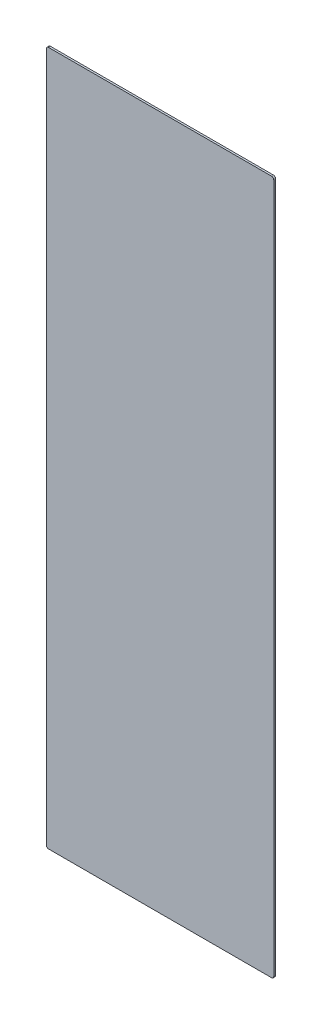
ISO-10303-21;
HEADER;
FILE_DESCRIPTION(('STEP AP214'),'2;1');
FILE_NAME('part.step','',(''),(''),'','','');
FILE_SCHEMA(('AUTOMOTIVE_DESIGN { 1 0 10303 214 1 1 1 1 }'));
ENDSEC;
DATA;
#1=APPLICATION_CONTEXT('core data for automotive mechanical design processes');
#2=APPLICATION_PROTOCOL_DEFINITION('international standard','automotive_design',2000,#1);
#3=PRODUCT_CONTEXT('',#1,'mechanical');
#4=PRODUCT('Part','Part','',(#3));
#5=PRODUCT_RELATED_PRODUCT_CATEGORY('part','',(#4));
#6=PRODUCT_DEFINITION_FORMATION('','',#4);
#7=PRODUCT_DEFINITION_CONTEXT('part definition',#1,'design');
#8=PRODUCT_DEFINITION('design','',#6,#7);
#9=PRODUCT_DEFINITION_SHAPE('','',#8);
#10=(LENGTH_UNIT() NAMED_UNIT(*) SI_UNIT(.MILLI.,.METRE.));
#11=(NAMED_UNIT(*) PLANE_ANGLE_UNIT() SI_UNIT($,.RADIAN.));
#12=(NAMED_UNIT(*) SI_UNIT($,.STERADIAN.) SOLID_ANGLE_UNIT());
#13=UNCERTAINTY_MEASURE_WITH_UNIT(LENGTH_MEASURE(1.E-05),#10,'distance_accuracy_value','');
#14=(GEOMETRIC_REPRESENTATION_CONTEXT(3) GLOBAL_UNCERTAINTY_ASSIGNED_CONTEXT((#13)) GLOBAL_UNIT_ASSIGNED_CONTEXT((#10,
#11,#12)) REPRESENTATION_CONTEXT('',''));
#15=CARTESIAN_POINT('',(0.,0.,0.));
#16=DIRECTION('',(0.,0.,1.));
#17=DIRECTION('',(1.,0.,0.));
#18=AXIS2_PLACEMENT_3D('',#15,#16,#17);
#19=CARTESIAN_POINT('',(250.,762.999999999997,2.0000000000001));
#20=DIRECTION('',(0.,-1.,0.));
#21=DIRECTION('',(0.,0.,-1.));
#22=AXIS2_PLACEMENT_3D('',#19,#20,#21);
#23=PLANE('',#22);
#24=DIRECTION('',(0.,0.,1.));
#25=VECTOR('',#24,1.);
#26=CARTESIAN_POINT('',(245.,762.999999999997,-1.9999999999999));
#27=LINE('',#26,#25);
#28=CARTESIAN_POINT('',(245.,762.999999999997,2.0000000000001));
#29=VERTEX_POINT('',#28);
#30=CARTESIAN_POINT('',(245.,762.999999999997,-2.2499999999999));
#31=VERTEX_POINT('',#30);
#32=EDGE_CURVE('E48',#29,#31,#27,.F.);
#33=ORIENTED_EDGE('',*,*,#32,.T.);
#34=DIRECTION('',(1.,0.,0.));
#35=VECTOR('',#34,1.);
#36=CARTESIAN_POINT('',(-245.,762.999999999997,-2.2499999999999));
#37=LINE('',#36,#35);
#38=CARTESIAN_POINT('',(-245.,762.999999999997,-2.2499999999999));
#39=VERTEX_POINT('',#38);
#40=EDGE_CURVE('E274',#39,#31,#37,.T.);
#41=ORIENTED_EDGE('',*,*,#40,.F.);
#42=DIRECTION('',(0.,0.,1.));
#43=VECTOR('',#42,1.);
#44=CARTESIAN_POINT('',(-245.,762.999999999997,2.0000000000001));
#45=LINE('',#44,#43);
#46=CARTESIAN_POINT('',(-245.,762.999999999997,2.0000000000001));
#47=VERTEX_POINT('',#46);
#48=EDGE_CURVE('E11',#39,#47,#45,.T.);
#49=ORIENTED_EDGE('',*,*,#48,.T.);
#50=DIRECTION('',(-1.,0.,0.));
#51=VECTOR('',#50,1.);
#52=CARTESIAN_POINT('',(250.,762.999999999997,2.0000000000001));
#53=LINE('',#52,#51);
#54=EDGE_CURVE('E290',#29,#47,#53,.T.);
#55=ORIENTED_EDGE('',*,*,#54,.F.);
#56=EDGE_LOOP('',(#33,#41,#49,#55));
#57=FACE_BOUND('',#56,.T.);
#58=ADVANCED_FACE('F39',(#57),#23,.F.);
#59=CARTESIAN_POINT('',(250.,762.999999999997,2.0000000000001));
#60=DIRECTION('',(0.,0.,-1.));
#61=DIRECTION('',(0.,1.,0.));
#62=AXIS2_PLACEMENT_3D('',#59,#60,#61);
#63=PLANE('',#62);
#64=DIRECTION('',(-1.,0.,0.));
#65=VECTOR('',#64,1.);
#66=CARTESIAN_POINT('',(250.,-763.000000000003,1.99999999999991));
#67=LINE('',#66,#65);
#68=CARTESIAN_POINT('',(245.,-763.000000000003,1.99999999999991));
#69=VERTEX_POINT('',#68);
#70=CARTESIAN_POINT('',(-245.,-763.000000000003,1.99999999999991));
#71=VERTEX_POINT('',#70);
#72=EDGE_CURVE('E283',#69,#71,#67,.T.);
#73=ORIENTED_EDGE('',*,*,#72,.F.);
#74=CARTESIAN_POINT('',(245.,-758.000000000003,1.99999999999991));
#75=DIRECTION('',(0.,0.,-1.));
#76=DIRECTION('',(0.,1.,0.));
#77=AXIS2_PLACEMENT_3D('',#74,#75,#76);
#78=CIRCLE('',#77,5.);
#79=CARTESIAN_POINT('',(250.,-758.000000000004,1.99999999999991));
#80=VERTEX_POINT('',#79);
#81=EDGE_CURVE('E315',#69,#80,#78,.F.);
#82=ORIENTED_EDGE('',*,*,#81,.T.);
#83=DIRECTION('',(0.,-1.,0.));
#84=VECTOR('',#83,1.);
#85=CARTESIAN_POINT('',(250.,762.999999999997,2.0000000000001));
#86=LINE('',#85,#84);
#87=CARTESIAN_POINT('',(250.,757.999999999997,2.0000000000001));
#88=VERTEX_POINT('',#87);
#89=EDGE_CURVE('E279',#88,#80,#86,.T.);
#90=ORIENTED_EDGE('',*,*,#89,.F.);
#91=CARTESIAN_POINT('',(245.,757.999999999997,2.0000000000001));
#92=DIRECTION('',(0.,0.,-1.));
#93=DIRECTION('',(0.,1.,0.));
#94=AXIS2_PLACEMENT_3D('',#91,#92,#93);
#95=CIRCLE('',#94,5.);
#96=EDGE_CURVE('E307',#88,#29,#95,.F.);
#97=ORIENTED_EDGE('',*,*,#96,.T.);
#98=ORIENTED_EDGE('',*,*,#54,.T.);
#99=CARTESIAN_POINT('',(-245.,757.999999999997,2.0000000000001));
#100=DIRECTION('',(0.,0.,-1.));
#101=DIRECTION('',(0.,1.,0.));
#102=AXIS2_PLACEMENT_3D('',#99,#100,#101);
#103=CIRCLE('',#102,5.);
#104=CARTESIAN_POINT('',(-250.,757.999999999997,2.0000000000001));
#105=VERTEX_POINT('',#104);
#106=EDGE_CURVE('E63',#47,#105,#103,.F.);
#107=ORIENTED_EDGE('',*,*,#106,.T.);
#108=DIRECTION('',(0.,-1.,0.));
#109=VECTOR('',#108,1.);
#110=CARTESIAN_POINT('',(-250.,762.999999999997,2.0000000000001));
#111=LINE('',#110,#109);
#112=CARTESIAN_POINT('',(-250.,-758.000000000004,1.99999999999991));
#113=VERTEX_POINT('',#112);
#114=EDGE_CURVE('E278',#105,#113,#111,.T.);
#115=ORIENTED_EDGE('',*,*,#114,.T.);
#116=CARTESIAN_POINT('',(-245.,-758.000000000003,1.99999999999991));
#117=DIRECTION('',(0.,0.,-1.));
#118=DIRECTION('',(0.,1.,0.));
#119=AXIS2_PLACEMENT_3D('',#116,#117,#118);
#120=CIRCLE('',#119,5.);
#121=EDGE_CURVE('E312',#113,#71,#120,.F.);
#122=ORIENTED_EDGE('',*,*,#121,.T.);
#123=EDGE_LOOP('',(#73,#82,#90,#97,#98,#107,#115,#122));
#124=FACE_BOUND('',#123,.T.);
#125=ADVANCED_FACE('F348',(#124),#63,.F.);
#126=CARTESIAN_POINT('',(250.,-763.000000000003,1.99999999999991));
#127=DIRECTION('',(0.,1.,0.));
#128=DIRECTION('',(0.,0.,1.));
#129=AXIS2_PLACEMENT_3D('',#126,#127,#128);
#130=PLANE('',#129);
#131=DIRECTION('',(0.,0.,-1.));
#132=VECTOR('',#131,1.);
#133=CARTESIAN_POINT('',(-245.,-763.000000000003,1.99999999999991));
#134=LINE('',#133,#132);
#135=CARTESIAN_POINT('',(-245.,-763.000000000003,-2.25000000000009));
#136=VERTEX_POINT('',#135);
#137=EDGE_CURVE('E301',#71,#136,#134,.T.);
#138=ORIENTED_EDGE('',*,*,#137,.T.);
#139=DIRECTION('',(-1.,0.,0.));
#140=VECTOR('',#139,1.);
#141=CARTESIAN_POINT('',(245.,-763.000000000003,-2.25000000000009));
#142=LINE('',#141,#140);
#143=CARTESIAN_POINT('',(245.,-763.000000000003,-2.25000000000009));
#144=VERTEX_POINT('',#143);
#145=EDGE_CURVE('E258',#144,#136,#142,.T.);
#146=ORIENTED_EDGE('',*,*,#145,.F.);
#147=DIRECTION('',(0.,0.,-1.));
#148=VECTOR('',#147,1.);
#149=CARTESIAN_POINT('',(245.,-763.000000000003,1.99999999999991));
#150=LINE('',#149,#148);
#151=EDGE_CURVE('E304',#144,#69,#150,.F.);
#152=ORIENTED_EDGE('',*,*,#151,.T.);
#153=ORIENTED_EDGE('',*,*,#72,.T.);
#154=EDGE_LOOP('',(#138,#146,#152,#153));
#155=FACE_BOUND('',#154,.T.);
#156=ADVANCED_FACE('F345',(#155),#130,.F.);
#157=CARTESIAN_POINT('',(250.,0.,0.));
#158=DIRECTION('',(1.,0.,0.));
#159=DIRECTION('',(0.,0.,-1.));
#160=AXIS2_PLACEMENT_3D('',#157,#158,#159);
#161=PLANE('',#160);
#162=ORIENTED_EDGE('',*,*,#89,.T.);
#163=DIRECTION('',(0.,0.,-1.));
#164=VECTOR('',#163,1.);
#165=CARTESIAN_POINT('',(250.,-758.000000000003,-2.00000000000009));
#166=LINE('',#165,#164);
#167=CARTESIAN_POINT('',(250.,-758.000000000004,-2.25000000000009));
#168=VERTEX_POINT('',#167);
#169=EDGE_CURVE('E298',#80,#168,#166,.T.);
#170=ORIENTED_EDGE('',*,*,#169,.T.);
#171=DIRECTION('',(0.,-1.,0.));
#172=VECTOR('',#171,1.);
#173=CARTESIAN_POINT('',(250.,757.999999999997,-2.2499999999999));
#174=LINE('',#173,#172);
#175=CARTESIAN_POINT('',(250.,757.999999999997,-2.2499999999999));
#176=VERTEX_POINT('',#175);
#177=EDGE_CURVE('E250',#176,#168,#174,.T.);
#178=ORIENTED_EDGE('',*,*,#177,.F.);
#179=DIRECTION('',(0.,0.,1.));
#180=VECTOR('',#179,1.);
#181=CARTESIAN_POINT('',(250.,757.999999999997,2.0000000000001));
#182=LINE('',#181,#180);
#183=EDGE_CURVE('E294',#176,#88,#182,.T.);
#184=ORIENTED_EDGE('',*,*,#183,.T.);
#185=EDGE_LOOP('',(#162,#170,#178,#184));
#186=FACE_BOUND('',#185,.T.);
#187=ADVANCED_FACE('F336',(#186),#161,.T.);
#188=CARTESIAN_POINT('',(-250.,0.,0.));
#189=DIRECTION('',(1.,0.,0.));
#190=DIRECTION('',(0.,0.,-1.));
#191=AXIS2_PLACEMENT_3D('',#188,#189,#190);
#192=PLANE('',#191);
#193=DIRECTION('',(0.,0.,1.));
#194=VECTOR('',#193,1.);
#195=CARTESIAN_POINT('',(-250.,757.999999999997,0.));
#196=LINE('',#195,#194);
#197=CARTESIAN_POINT('',(-250.,757.999999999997,-2.2499999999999));
#198=VERTEX_POINT('',#197);
#199=EDGE_CURVE('E318',#105,#198,#196,.F.);
#200=ORIENTED_EDGE('',*,*,#199,.T.);
#201=DIRECTION('',(0.,1.,0.));
#202=VECTOR('',#201,1.);
#203=CARTESIAN_POINT('',(-250.,-758.000000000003,-2.25000000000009));
#204=LINE('',#203,#202);
#205=CARTESIAN_POINT('',(-250.,-758.000000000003,-2.25000000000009));
#206=VERTEX_POINT('',#205);
#207=EDGE_CURVE('E266',#206,#198,#204,.T.);
#208=ORIENTED_EDGE('',*,*,#207,.F.);
#209=DIRECTION('',(0.,0.,-1.));
#210=VECTOR('',#209,1.);
#211=CARTESIAN_POINT('',(-250.,-758.000000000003,0.));
#212=LINE('',#211,#210);
#213=EDGE_CURVE('E321',#206,#113,#212,.F.);
#214=ORIENTED_EDGE('',*,*,#213,.T.);
#215=ORIENTED_EDGE('',*,*,#114,.F.);
#216=EDGE_LOOP('',(#200,#208,#214,#215));
#217=FACE_BOUND('',#216,.T.);
#218=ADVANCED_FACE('F356',(#217),#192,.F.);
#219=CARTESIAN_POINT('',(245.,-758.000000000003,0.));
#220=DIRECTION('',(0.,0.,1.));
#221=DIRECTION('',(1.,0.,0.));
#222=AXIS2_PLACEMENT_3D('',#219,#220,#221);
#223=CYLINDRICAL_SURFACE('',#222,5.);
#224=ORIENTED_EDGE('',*,*,#81,.F.);
#225=ORIENTED_EDGE('',*,*,#151,.F.);
#226=CARTESIAN_POINT('',(245.,-758.000000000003,-2.25000000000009));
#227=DIRECTION('',(0.,0.,-1.));
#228=DIRECTION('',(0.,1.,0.));
#229=AXIS2_PLACEMENT_3D('',#226,#227,#228);
#230=CIRCLE('',#229,5.);
#231=EDGE_CURVE('E254',#168,#144,#230,.T.);
#232=ORIENTED_EDGE('',*,*,#231,.F.);
#233=ORIENTED_EDGE('',*,*,#169,.F.);
#234=EDGE_LOOP('',(#224,#225,#232,#233));
#235=FACE_BOUND('',#234,.T.);
#236=ADVANCED_FACE('F342',(#235),#223,.T.);
#237=CARTESIAN_POINT('',(-245.,-758.000000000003,1.99999999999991));
#238=DIRECTION('',(0.,0.,-1.));
#239=DIRECTION('',(-1.,0.,0.));
#240=AXIS2_PLACEMENT_3D('',#237,#238,#239);
#241=CYLINDRICAL_SURFACE('',#240,5.);
#242=ORIENTED_EDGE('',*,*,#121,.F.);
#243=ORIENTED_EDGE('',*,*,#213,.F.);
#244=CARTESIAN_POINT('',(-245.,-758.000000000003,-2.25000000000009));
#245=DIRECTION('',(0.,0.,-1.));
#246=DIRECTION('',(0.,1.,0.));
#247=AXIS2_PLACEMENT_3D('',#244,#245,#246);
#248=CIRCLE('',#247,5.);
#249=EDGE_CURVE('E262',#136,#206,#248,.T.);
#250=ORIENTED_EDGE('',*,*,#249,.F.);
#251=ORIENTED_EDGE('',*,*,#137,.F.);
#252=EDGE_LOOP('',(#242,#243,#250,#251));
#253=FACE_BOUND('',#252,.T.);
#254=ADVANCED_FACE('F352',(#253),#241,.T.);
#255=CARTESIAN_POINT('',(-245.,757.999999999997,2.0000000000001));
#256=DIRECTION('',(0.,0.,1.));
#257=DIRECTION('',(1.,0.,0.));
#258=AXIS2_PLACEMENT_3D('',#255,#256,#257);
#259=CYLINDRICAL_SURFACE('',#258,5.);
#260=ORIENTED_EDGE('',*,*,#48,.F.);
#261=CARTESIAN_POINT('',(-245.,757.999999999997,-2.2499999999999));
#262=DIRECTION('',(0.,0.,-1.));
#263=DIRECTION('',(0.,1.,0.));
#264=AXIS2_PLACEMENT_3D('',#261,#262,#263);
#265=CIRCLE('',#264,5.);
#266=EDGE_CURVE('E270',#198,#39,#265,.T.);
#267=ORIENTED_EDGE('',*,*,#266,.F.);
#268=ORIENTED_EDGE('',*,*,#199,.F.);
#269=ORIENTED_EDGE('',*,*,#106,.F.);
#270=EDGE_LOOP('',(#260,#267,#268,#269));
#271=FACE_BOUND('',#270,.T.);
#272=ADVANCED_FACE('F357',(#271),#259,.T.);
#273=CARTESIAN_POINT('',(245.,757.999999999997,0.));
#274=DIRECTION('',(0.,0.,-1.));
#275=DIRECTION('',(-1.,0.,0.));
#276=AXIS2_PLACEMENT_3D('',#273,#274,#275);
#277=CYLINDRICAL_SURFACE('',#276,5.);
#278=ORIENTED_EDGE('',*,*,#183,.F.);
#279=CARTESIAN_POINT('',(245.,757.999999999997,-2.2499999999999));
#280=DIRECTION('',(0.,0.,-1.));
#281=DIRECTION('',(0.,1.,0.));
#282=AXIS2_PLACEMENT_3D('',#279,#280,#281);
#283=CIRCLE('',#282,5.);
#284=EDGE_CURVE('E229',#31,#176,#283,.T.);
#285=ORIENTED_EDGE('',*,*,#284,.F.);
#286=ORIENTED_EDGE('',*,*,#32,.F.);
#287=ORIENTED_EDGE('',*,*,#96,.F.);
#288=EDGE_LOOP('',(#278,#285,#286,#287));
#289=FACE_BOUND('',#288,.T.);
#290=ADVANCED_FACE('F41',(#289),#277,.T.);
#291=CARTESIAN_POINT('',(245.,757.999999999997,-2.2499999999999));
#292=DIRECTION('',(0.,0.,-1.));
#293=DIRECTION('',(0.,1.,0.));
#294=AXIS2_PLACEMENT_3D('',#291,#292,#293);
#295=PLANE('',#294);
#296=CARTESIAN_POINT('',(-185.,-697.5,-2.25000000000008));
#297=DIRECTION('',(0.,0.,-1.));
#298=DIRECTION('',(0.,1.,0.));
#299=AXIS2_PLACEMENT_3D('',#296,#297,#298);
#300=CIRCLE('',#299,25.);
#301=CARTESIAN_POINT('',(-185.,-722.5,-2.25000000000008));
#302=VERTEX_POINT('',#301);
#303=CARTESIAN_POINT('',(-210.,-697.5,-2.25000000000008));
#304=VERTEX_POINT('',#303);
#305=EDGE_CURVE('E55',#302,#304,#300,.T.);
#306=ORIENTED_EDGE('',*,*,#305,.F.);
#307=DIRECTION('',(-1.,0.,0.));
#308=VECTOR('',#307,1.);
#309=CARTESIAN_POINT('',(185.,-722.5,-2.25000000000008));
#310=LINE('',#309,#308);
#311=CARTESIAN_POINT('',(185.,-722.5,-2.25000000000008));
#312=VERTEX_POINT('',#311);
#313=EDGE_CURVE('E176',#312,#302,#310,.T.);
#314=ORIENTED_EDGE('',*,*,#313,.F.);
#315=CARTESIAN_POINT('',(185.,-697.5,-2.25000000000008));
#316=DIRECTION('',(0.,0.,-1.));
#317=DIRECTION('',(0.,1.,0.));
#318=AXIS2_PLACEMENT_3D('',#315,#316,#317);
#319=CIRCLE('',#318,25.);
#320=CARTESIAN_POINT('',(210.,-697.5,-2.25000000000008));
#321=VERTEX_POINT('',#320);
#322=EDGE_CURVE('E180',#321,#312,#319,.T.);
#323=ORIENTED_EDGE('',*,*,#322,.F.);
#324=DIRECTION('',(0.,-1.,0.));
#325=VECTOR('',#324,1.);
#326=CARTESIAN_POINT('',(210.,697.5,-2.24999999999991));
#327=LINE('',#326,#325);
#328=CARTESIAN_POINT('',(210.,697.5,-2.24999999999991));
#329=VERTEX_POINT('',#328);
#330=EDGE_CURVE('E219',#329,#321,#327,.T.);
#331=ORIENTED_EDGE('',*,*,#330,.F.);
#332=CARTESIAN_POINT('',(185.,697.5,-2.24999999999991));
#333=DIRECTION('',(0.,0.,-1.));
#334=DIRECTION('',(0.,1.,0.));
#335=AXIS2_PLACEMENT_3D('',#332,#333,#334);
#336=CIRCLE('',#335,25.);
#337=CARTESIAN_POINT('',(185.,722.5,-2.24999999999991));
#338=VERTEX_POINT('',#337);
#339=EDGE_CURVE('E215',#338,#329,#336,.T.);
#340=ORIENTED_EDGE('',*,*,#339,.F.);
#341=DIRECTION('',(1.,0.,0.));
#342=VECTOR('',#341,1.);
#343=CARTESIAN_POINT('',(185.,722.5,-2.24999999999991));
#344=LINE('',#343,#342);
#345=CARTESIAN_POINT('',(-185.,722.5,-2.24999999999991));
#346=VERTEX_POINT('',#345);
#347=EDGE_CURVE('E211',#346,#338,#344,.T.);
#348=ORIENTED_EDGE('',*,*,#347,.F.);
#349=CARTESIAN_POINT('',(-185.,697.5,-2.24999999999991));
#350=DIRECTION('',(0.,0.,-1.));
#351=DIRECTION('',(0.,-1.,0.));
#352=AXIS2_PLACEMENT_3D('',#349,#350,#351);
#353=CIRCLE('',#352,25.);
#354=CARTESIAN_POINT('',(-210.,697.5,-2.24999999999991));
#355=VERTEX_POINT('',#354);
#356=EDGE_CURVE('E207',#355,#346,#353,.T.);
#357=ORIENTED_EDGE('',*,*,#356,.F.);
#358=DIRECTION('',(0.,1.,0.));
#359=VECTOR('',#358,1.);
#360=CARTESIAN_POINT('',(-210.,697.5,-2.24999999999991));
#361=LINE('',#360,#359);
#362=EDGE_CURVE('E204',#304,#355,#361,.T.);
#363=ORIENTED_EDGE('',*,*,#362,.F.);
#364=EDGE_LOOP('',(#306,#314,#323,#331,#340,#348,#357,#363));
#365=FACE_BOUND('',#364,.T.);
#366=ORIENTED_EDGE('',*,*,#284,.T.);
#367=ORIENTED_EDGE('',*,*,#177,.T.);
#368=ORIENTED_EDGE('',*,*,#231,.T.);
#369=ORIENTED_EDGE('',*,*,#145,.T.);
#370=ORIENTED_EDGE('',*,*,#249,.T.);
#371=ORIENTED_EDGE('',*,*,#207,.T.);
#372=ORIENTED_EDGE('',*,*,#266,.T.);
#373=ORIENTED_EDGE('',*,*,#40,.T.);
#374=EDGE_LOOP('',(#366,#367,#368,#369,#370,#371,#372,#373));
#375=FACE_BOUND('',#374,.T.);
#376=ADVANCED_FACE('F331',(#365,#375),#295,.T.);
#377=CARTESIAN_POINT('',(-185.,-697.5,-2.00000000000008));
#378=DIRECTION('',(0.,0.,-1.));
#379=DIRECTION('',(0.,1.,0.));
#380=AXIS2_PLACEMENT_3D('',#377,#378,#379);
#381=CYLINDRICAL_SURFACE('',#380,25.);
#382=ORIENTED_EDGE('',*,*,#305,.T.);
#383=DIRECTION('',(0.,0.,-1.));
#384=VECTOR('',#383,1.);
#385=CARTESIAN_POINT('',(-210.,-697.5,-2.00000000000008));
#386=LINE('',#385,#384);
#387=CARTESIAN_POINT('',(-210.,-697.5,-2.00000000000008));
#388=VERTEX_POINT('',#387);
#389=EDGE_CURVE('E150',#388,#304,#386,.T.);
#390=ORIENTED_EDGE('',*,*,#389,.F.);
#391=CARTESIAN_POINT('',(-185.,-697.5,-2.00000000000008));
#392=DIRECTION('',(0.,0.,-1.));
#393=DIRECTION('',(0.,1.,0.));
#394=AXIS2_PLACEMENT_3D('',#391,#392,#393);
#395=CIRCLE('',#394,25.);
#396=CARTESIAN_POINT('',(-185.,-722.5,-2.00000000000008));
#397=VERTEX_POINT('',#396);
#398=EDGE_CURVE('E154',#397,#388,#395,.T.);
#399=ORIENTED_EDGE('',*,*,#398,.F.);
#400=DIRECTION('',(0.,0.,-1.));
#401=VECTOR('',#400,1.);
#402=CARTESIAN_POINT('',(-185.,-722.5,-2.00000000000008));
#403=LINE('',#402,#401);
#404=EDGE_CURVE('E226',#397,#302,#403,.T.);
#405=ORIENTED_EDGE('',*,*,#404,.T.);
#406=EDGE_LOOP('',(#382,#390,#399,#405));
#407=FACE_BOUND('',#406,.T.);
#408=ADVANCED_FACE('F152',(#407),#381,.F.);
#409=CARTESIAN_POINT('',(185.,-722.5,-2.00000000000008));
#410=DIRECTION('',(0.,-1.,0.));
#411=DIRECTION('',(0.,0.,-1.));
#412=AXIS2_PLACEMENT_3D('',#409,#410,#411);
#413=PLANE('',#412);
#414=ORIENTED_EDGE('',*,*,#313,.T.);
#415=ORIENTED_EDGE('',*,*,#404,.F.);
#416=DIRECTION('',(-1.,0.,0.));
#417=VECTOR('',#416,1.);
#418=CARTESIAN_POINT('',(185.,-722.5,-2.00000000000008));
#419=LINE('',#418,#417);
#420=CARTESIAN_POINT('',(185.,-722.5,-2.00000000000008));
#421=VERTEX_POINT('',#420);
#422=EDGE_CURVE('E161',#421,#397,#419,.T.);
#423=ORIENTED_EDGE('',*,*,#422,.F.);
#424=DIRECTION('',(0.,0.,-1.));
#425=VECTOR('',#424,1.);
#426=CARTESIAN_POINT('',(185.,-722.5,-2.00000000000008));
#427=LINE('',#426,#425);
#428=EDGE_CURVE('E230',#421,#312,#427,.T.);
#429=ORIENTED_EDGE('',*,*,#428,.T.);
#430=EDGE_LOOP('',(#414,#415,#423,#429));
#431=FACE_BOUND('',#430,.T.);
#432=ADVANCED_FACE('F437',(#431),#413,.F.);
#433=CARTESIAN_POINT('',(185.,-697.5,-2.00000000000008));
#434=DIRECTION('',(0.,0.,-1.));
#435=DIRECTION('',(0.,1.,0.));
#436=AXIS2_PLACEMENT_3D('',#433,#434,#435);
#437=CYLINDRICAL_SURFACE('',#436,25.);
#438=ORIENTED_EDGE('',*,*,#322,.T.);
#439=ORIENTED_EDGE('',*,*,#428,.F.);
#440=CARTESIAN_POINT('',(185.,-697.5,-2.00000000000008));
#441=DIRECTION('',(0.,0.,-1.));
#442=DIRECTION('',(0.,1.,0.));
#443=AXIS2_PLACEMENT_3D('',#440,#441,#442);
#444=CIRCLE('',#443,25.);
#445=CARTESIAN_POINT('',(210.,-697.5,-2.00000000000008));
#446=VERTEX_POINT('',#445);
#447=EDGE_CURVE('E197',#446,#421,#444,.T.);
#448=ORIENTED_EDGE('',*,*,#447,.F.);
#449=DIRECTION('',(0.,0.,-1.));
#450=VECTOR('',#449,1.);
#451=CARTESIAN_POINT('',(210.,-697.5,-2.00000000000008));
#452=LINE('',#451,#450);
#453=EDGE_CURVE('E233',#446,#321,#452,.T.);
#454=ORIENTED_EDGE('',*,*,#453,.T.);
#455=EDGE_LOOP('',(#438,#439,#448,#454));
#456=FACE_BOUND('',#455,.T.);
#457=ADVANCED_FACE('F446',(#456),#437,.F.);
#458=CARTESIAN_POINT('',(210.,697.5,-1.99999999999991));
#459=DIRECTION('',(1.,0.,0.));
#460=DIRECTION('',(0.,1.,0.));
#461=AXIS2_PLACEMENT_3D('',#458,#459,#460);
#462=PLANE('',#461);
#463=ORIENTED_EDGE('',*,*,#330,.T.);
#464=ORIENTED_EDGE('',*,*,#453,.F.);
#465=DIRECTION('',(0.,-1.,0.));
#466=VECTOR('',#465,1.);
#467=CARTESIAN_POINT('',(210.,697.5,-1.99999999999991));
#468=LINE('',#467,#466);
#469=CARTESIAN_POINT('',(210.,697.5,-1.99999999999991));
#470=VERTEX_POINT('',#469);
#471=EDGE_CURVE('E193',#470,#446,#468,.T.);
#472=ORIENTED_EDGE('',*,*,#471,.F.);
#473=DIRECTION('',(0.,0.,-1.));
#474=VECTOR('',#473,1.);
#475=CARTESIAN_POINT('',(210.,697.5,-1.99999999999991));
#476=LINE('',#475,#474);
#477=EDGE_CURVE('E236',#470,#329,#476,.T.);
#478=ORIENTED_EDGE('',*,*,#477,.T.);
#479=EDGE_LOOP('',(#463,#464,#472,#478));
#480=FACE_BOUND('',#479,.T.);
#481=ADVANCED_FACE('F456',(#480),#462,.F.);
#482=CARTESIAN_POINT('',(185.,697.5,-1.99999999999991));
#483=DIRECTION('',(0.,0.,-1.));
#484=DIRECTION('',(0.,1.,0.));
#485=AXIS2_PLACEMENT_3D('',#482,#483,#484);
#486=CYLINDRICAL_SURFACE('',#485,25.);
#487=ORIENTED_EDGE('',*,*,#339,.T.);
#488=ORIENTED_EDGE('',*,*,#477,.F.);
#489=CARTESIAN_POINT('',(185.,697.5,-1.99999999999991));
#490=DIRECTION('',(0.,0.,-1.));
#491=DIRECTION('',(0.,1.,0.));
#492=AXIS2_PLACEMENT_3D('',#489,#490,#491);
#493=CIRCLE('',#492,25.);
#494=CARTESIAN_POINT('',(185.,722.5,-1.99999999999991));
#495=VERTEX_POINT('',#494);
#496=EDGE_CURVE('E189',#495,#470,#493,.T.);
#497=ORIENTED_EDGE('',*,*,#496,.F.);
#498=DIRECTION('',(0.,0.,-1.));
#499=VECTOR('',#498,1.);
#500=CARTESIAN_POINT('',(185.,722.5,-1.99999999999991));
#501=LINE('',#500,#499);
#502=EDGE_CURVE('E239',#495,#338,#501,.T.);
#503=ORIENTED_EDGE('',*,*,#502,.T.);
#504=EDGE_LOOP('',(#487,#488,#497,#503));
#505=FACE_BOUND('',#504,.T.);
#506=ADVANCED_FACE('F466',(#505),#486,.F.);
#507=CARTESIAN_POINT('',(185.,722.5,-1.99999999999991));
#508=DIRECTION('',(0.,1.,0.));
#509=DIRECTION('',(0.,0.,1.));
#510=AXIS2_PLACEMENT_3D('',#507,#508,#509);
#511=PLANE('',#510);
#512=ORIENTED_EDGE('',*,*,#347,.T.);
#513=ORIENTED_EDGE('',*,*,#502,.F.);
#514=DIRECTION('',(1.,0.,0.));
#515=VECTOR('',#514,1.);
#516=CARTESIAN_POINT('',(185.,722.5,-1.99999999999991));
#517=LINE('',#516,#515);
#518=CARTESIAN_POINT('',(-185.,722.5,-1.99999999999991));
#519=VERTEX_POINT('',#518);
#520=EDGE_CURVE('E185',#519,#495,#517,.T.);
#521=ORIENTED_EDGE('',*,*,#520,.F.);
#522=DIRECTION('',(0.,0.,-1.));
#523=VECTOR('',#522,1.);
#524=CARTESIAN_POINT('',(-185.,722.5,-1.99999999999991));
#525=LINE('',#524,#523);
#526=EDGE_CURVE('E242',#519,#346,#525,.T.);
#527=ORIENTED_EDGE('',*,*,#526,.T.);
#528=EDGE_LOOP('',(#512,#513,#521,#527));
#529=FACE_BOUND('',#528,.T.);
#530=ADVANCED_FACE('F476',(#529),#511,.F.);
#531=CARTESIAN_POINT('',(-185.,697.5,-1.99999999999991));
#532=DIRECTION('',(0.,0.,-1.));
#533=DIRECTION('',(0.,1.,0.));
#534=AXIS2_PLACEMENT_3D('',#531,#532,#533);
#535=CYLINDRICAL_SURFACE('',#534,25.);
#536=ORIENTED_EDGE('',*,*,#356,.T.);
#537=ORIENTED_EDGE('',*,*,#526,.F.);
#538=CARTESIAN_POINT('',(-185.,697.5,-1.99999999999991));
#539=DIRECTION('',(0.,0.,-1.));
#540=DIRECTION('',(0.,-1.,0.));
#541=AXIS2_PLACEMENT_3D('',#538,#539,#540);
#542=CIRCLE('',#541,25.);
#543=CARTESIAN_POINT('',(-210.,697.5,-1.99999999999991));
#544=VERTEX_POINT('',#543);
#545=EDGE_CURVE('E170',#544,#519,#542,.T.);
#546=ORIENTED_EDGE('',*,*,#545,.F.);
#547=DIRECTION('',(0.,0.,-1.));
#548=VECTOR('',#547,1.);
#549=CARTESIAN_POINT('',(-210.,697.5,-1.99999999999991));
#550=LINE('',#549,#548);
#551=EDGE_CURVE('E160',#544,#355,#550,.T.);
#552=ORIENTED_EDGE('',*,*,#551,.T.);
#553=EDGE_LOOP('',(#536,#537,#546,#552));
#554=FACE_BOUND('',#553,.T.);
#555=ADVANCED_FACE('F486',(#554),#535,.F.);
#556=CARTESIAN_POINT('',(-210.,697.5,-1.99999999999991));
#557=DIRECTION('',(-1.,0.,0.));
#558=DIRECTION('',(0.,-1.,0.));
#559=AXIS2_PLACEMENT_3D('',#556,#557,#558);
#560=PLANE('',#559);
#561=ORIENTED_EDGE('',*,*,#362,.T.);
#562=ORIENTED_EDGE('',*,*,#551,.F.);
#563=DIRECTION('',(0.,1.,0.));
#564=VECTOR('',#563,1.);
#565=CARTESIAN_POINT('',(-210.,697.5,-1.99999999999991));
#566=LINE('',#565,#564);
#567=EDGE_CURVE('E164',#388,#544,#566,.T.);
#568=ORIENTED_EDGE('',*,*,#567,.F.);
#569=ORIENTED_EDGE('',*,*,#389,.T.);
#570=EDGE_LOOP('',(#561,#562,#568,#569));
#571=FACE_BOUND('',#570,.T.);
#572=ADVANCED_FACE('F165',(#571),#560,.F.);
#573=CARTESIAN_POINT('',(-185.,-697.5,-2.00000000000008));
#574=DIRECTION('',(0.,0.,-1.));
#575=DIRECTION('',(0.,1.,0.));
#576=AXIS2_PLACEMENT_3D('',#573,#574,#575);
#577=PLANE('',#576);
#578=ORIENTED_EDGE('',*,*,#398,.T.);
#579=ORIENTED_EDGE('',*,*,#567,.T.);
#580=ORIENTED_EDGE('',*,*,#545,.T.);
#581=ORIENTED_EDGE('',*,*,#520,.T.);
#582=ORIENTED_EDGE('',*,*,#496,.T.);
#583=ORIENTED_EDGE('',*,*,#471,.T.);
#584=ORIENTED_EDGE('',*,*,#447,.T.);
#585=ORIENTED_EDGE('',*,*,#422,.T.);
#586=EDGE_LOOP('',(#578,#579,#580,#581,#582,#583,#584,#585));
#587=FACE_BOUND('',#586,.T.);
#588=ADVANCED_FACE('F172',(#587),#577,.T.);
#589=CLOSED_SHELL('',(#58,#125,#156,#187,#218,#236,#254,#272,#290,#376,#408,#432,#457,#481,#506,
#530,#555,#572,#588));
#590=MANIFOLD_SOLID_BREP('B2',#589);
#591=ADVANCED_BREP_SHAPE_REPRESENTATION('',(#18,#590),#14);
#592=SHAPE_DEFINITION_REPRESENTATION(#9,#591);
ENDSEC;
END-ISO-10303-21;
